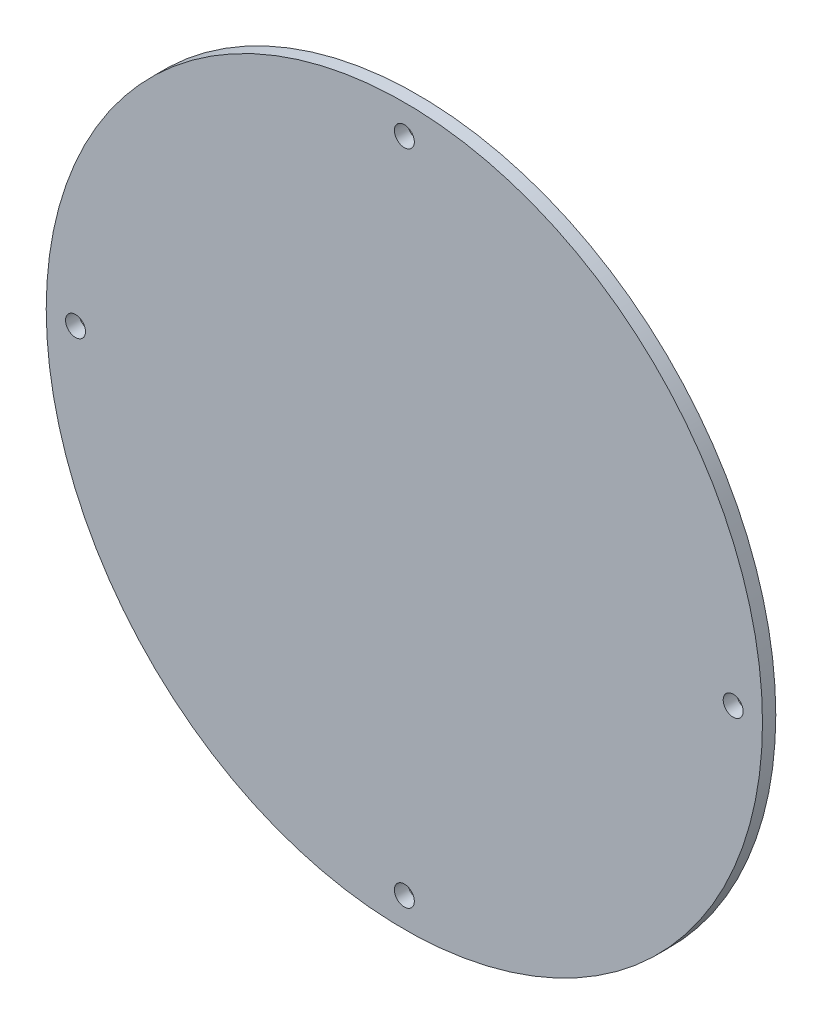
ISO-10303-21;
HEADER;
FILE_DESCRIPTION(('STEP AP214'),'2;1');
FILE_NAME('part.step','',(''),(''),'','','');
FILE_SCHEMA(('AUTOMOTIVE_DESIGN { 1 0 10303 214 1 1 1 1 }'));
ENDSEC;
DATA;
#1=APPLICATION_CONTEXT('core data for automotive mechanical design processes');
#2=APPLICATION_PROTOCOL_DEFINITION('international standard','automotive_design',2000,#1);
#3=PRODUCT_CONTEXT('',#1,'mechanical');
#4=PRODUCT('Part','Part','',(#3));
#5=PRODUCT_RELATED_PRODUCT_CATEGORY('part','',(#4));
#6=PRODUCT_DEFINITION_FORMATION('','',#4);
#7=PRODUCT_DEFINITION_CONTEXT('part definition',#1,'design');
#8=PRODUCT_DEFINITION('design','',#6,#7);
#9=PRODUCT_DEFINITION_SHAPE('','',#8);
#10=(LENGTH_UNIT() NAMED_UNIT(*) SI_UNIT(.MILLI.,.METRE.));
#11=(NAMED_UNIT(*) PLANE_ANGLE_UNIT() SI_UNIT($,.RADIAN.));
#12=(NAMED_UNIT(*) SI_UNIT($,.STERADIAN.) SOLID_ANGLE_UNIT());
#13=UNCERTAINTY_MEASURE_WITH_UNIT(LENGTH_MEASURE(1.E-05),#10,'distance_accuracy_value','');
#14=(GEOMETRIC_REPRESENTATION_CONTEXT(3) GLOBAL_UNCERTAINTY_ASSIGNED_CONTEXT((#13)) GLOBAL_UNIT_ASSIGNED_CONTEXT((#10,
#11,#12)) REPRESENTATION_CONTEXT('',''));
#15=CARTESIAN_POINT('',(0.,0.,0.));
#16=DIRECTION('',(0.,0.,1.));
#17=DIRECTION('',(1.,0.,0.));
#18=AXIS2_PLACEMENT_3D('',#15,#16,#17);
#19=CARTESIAN_POINT('',(0.,78.5,3.175));
#20=DIRECTION('',(0.,0.,-1.));
#21=DIRECTION('',(-1.,0.,0.));
#22=AXIS2_PLACEMENT_3D('',#19,#20,#21);
#23=CYLINDRICAL_SURFACE('',#22,2.38125);
#24=CARTESIAN_POINT('',(0.,78.5,3.175));
#25=DIRECTION('',(0.,0.,1.));
#26=DIRECTION('',(1.,0.,0.));
#27=AXIS2_PLACEMENT_3D('',#24,#25,#26);
#28=CIRCLE('',#27,2.38125);
#29=CARTESIAN_POINT('',(2.38125,78.5,3.175));
#30=VERTEX_POINT('',#29);
#31=EDGE_CURVE('E43',#30,#30,#28,.T.);
#32=ORIENTED_EDGE('',*,*,#31,.T.);
#33=EDGE_LOOP('',(#32));
#34=FACE_BOUND('',#33,.T.);
#35=CARTESIAN_POINT('',(0.,78.5,0.));
#36=DIRECTION('',(0.,0.,1.));
#37=DIRECTION('',(1.,0.,0.));
#38=AXIS2_PLACEMENT_3D('',#35,#36,#37);
#39=CIRCLE('',#38,2.38125);
#40=CARTESIAN_POINT('',(2.38125,78.5,0.));
#41=VERTEX_POINT('',#40);
#42=EDGE_CURVE('E60',#41,#41,#39,.T.);
#43=ORIENTED_EDGE('',*,*,#42,.F.);
#44=EDGE_LOOP('',(#43));
#45=FACE_BOUND('',#44,.T.);
#46=ADVANCED_FACE('F35',(#34,#45),#23,.F.);
#47=CARTESIAN_POINT('',(78.5,0.,3.175));
#48=DIRECTION('',(0.,0.,-1.));
#49=DIRECTION('',(-1.,0.,0.));
#50=AXIS2_PLACEMENT_3D('',#47,#48,#49);
#51=CYLINDRICAL_SURFACE('',#50,2.38125000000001);
#52=CARTESIAN_POINT('',(78.5,0.,3.175));
#53=DIRECTION('',(0.,0.,1.));
#54=DIRECTION('',(1.,0.,0.));
#55=AXIS2_PLACEMENT_3D('',#52,#53,#54);
#56=CIRCLE('',#55,2.38125000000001);
#57=CARTESIAN_POINT('',(80.88125,0.,3.175));
#58=VERTEX_POINT('',#57);
#59=EDGE_CURVE('E48',#58,#58,#56,.T.);
#60=ORIENTED_EDGE('',*,*,#59,.T.);
#61=EDGE_LOOP('',(#60));
#62=FACE_BOUND('',#61,.T.);
#63=CARTESIAN_POINT('',(78.5,0.,0.));
#64=DIRECTION('',(0.,0.,1.));
#65=DIRECTION('',(1.,0.,0.));
#66=AXIS2_PLACEMENT_3D('',#63,#64,#65);
#67=CIRCLE('',#66,2.38125000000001);
#68=CARTESIAN_POINT('',(80.88125,0.,0.));
#69=VERTEX_POINT('',#68);
#70=EDGE_CURVE('E58',#69,#69,#67,.T.);
#71=ORIENTED_EDGE('',*,*,#70,.F.);
#72=EDGE_LOOP('',(#71));
#73=FACE_BOUND('',#72,.T.);
#74=ADVANCED_FACE('F78',(#62,#73),#51,.F.);
#75=CARTESIAN_POINT('',(0.,-78.5,3.175));
#76=DIRECTION('',(0.,0.,-1.));
#77=DIRECTION('',(-1.,0.,0.));
#78=AXIS2_PLACEMENT_3D('',#75,#76,#77);
#79=CYLINDRICAL_SURFACE('',#78,2.38125);
#80=CARTESIAN_POINT('',(0.,-78.5,3.175));
#81=DIRECTION('',(0.,0.,1.));
#82=DIRECTION('',(1.,0.,0.));
#83=AXIS2_PLACEMENT_3D('',#80,#81,#82);
#84=CIRCLE('',#83,2.38125);
#85=CARTESIAN_POINT('',(2.38125000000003,-78.5,3.175));
#86=VERTEX_POINT('',#85);
#87=EDGE_CURVE('E69',#86,#86,#84,.T.);
#88=ORIENTED_EDGE('',*,*,#87,.T.);
#89=EDGE_LOOP('',(#88));
#90=FACE_BOUND('',#89,.T.);
#91=CARTESIAN_POINT('',(0.,-78.5,0.));
#92=DIRECTION('',(0.,0.,1.));
#93=DIRECTION('',(1.,0.,0.));
#94=AXIS2_PLACEMENT_3D('',#91,#92,#93);
#95=CIRCLE('',#94,2.38125);
#96=CARTESIAN_POINT('',(2.38125000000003,-78.5,0.));
#97=VERTEX_POINT('',#96);
#98=EDGE_CURVE('E55',#97,#97,#95,.T.);
#99=ORIENTED_EDGE('',*,*,#98,.F.);
#100=EDGE_LOOP('',(#99));
#101=FACE_BOUND('',#100,.T.);
#102=ADVANCED_FACE('F96',(#90,#101),#79,.F.);
#103=CARTESIAN_POINT('',(-78.5,0.,3.175));
#104=DIRECTION('',(0.,0.,-1.));
#105=DIRECTION('',(-1.,0.,0.));
#106=AXIS2_PLACEMENT_3D('',#103,#104,#105);
#107=CYLINDRICAL_SURFACE('',#106,2.38125000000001);
#108=CARTESIAN_POINT('',(-78.5,0.,3.175));
#109=DIRECTION('',(0.,0.,1.));
#110=DIRECTION('',(1.,0.,0.));
#111=AXIS2_PLACEMENT_3D('',#108,#109,#110);
#112=CIRCLE('',#111,2.38125000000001);
#113=CARTESIAN_POINT('',(-76.11875,0.,3.175));
#114=VERTEX_POINT('',#113);
#115=EDGE_CURVE('E65',#114,#114,#112,.T.);
#116=ORIENTED_EDGE('',*,*,#115,.T.);
#117=EDGE_LOOP('',(#116));
#118=FACE_BOUND('',#117,.T.);
#119=CARTESIAN_POINT('',(-78.5,0.,0.));
#120=DIRECTION('',(0.,0.,1.));
#121=DIRECTION('',(1.,0.,0.));
#122=AXIS2_PLACEMENT_3D('',#119,#120,#121);
#123=CIRCLE('',#122,2.38125000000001);
#124=CARTESIAN_POINT('',(-76.11875,0.,0.));
#125=VERTEX_POINT('',#124);
#126=EDGE_CURVE('E52',#125,#125,#123,.T.);
#127=ORIENTED_EDGE('',*,*,#126,.F.);
#128=EDGE_LOOP('',(#127));
#129=FACE_BOUND('',#128,.T.);
#130=ADVANCED_FACE('F37',(#118,#129),#107,.F.);
#131=CARTESIAN_POINT('',(0.,0.,3.175));
#132=DIRECTION('',(0.,0.,-1.));
#133=DIRECTION('',(-1.,0.,0.));
#134=AXIS2_PLACEMENT_3D('',#131,#132,#133);
#135=CYLINDRICAL_SURFACE('',#134,85.5);
#136=CARTESIAN_POINT('',(0.,0.,3.175));
#137=DIRECTION('',(0.,0.,1.));
#138=DIRECTION('',(1.,0.,0.));
#139=AXIS2_PLACEMENT_3D('',#136,#137,#138);
#140=CIRCLE('',#139,85.5);
#141=CARTESIAN_POINT('',(85.5,0.,3.175));
#142=VERTEX_POINT('',#141);
#143=EDGE_CURVE('E10',#142,#142,#140,.T.);
#144=ORIENTED_EDGE('',*,*,#143,.F.);
#145=EDGE_LOOP('',(#144));
#146=FACE_BOUND('',#145,.T.);
#147=CARTESIAN_POINT('',(0.,0.,0.));
#148=DIRECTION('',(0.,0.,1.));
#149=DIRECTION('',(1.,0.,0.));
#150=AXIS2_PLACEMENT_3D('',#147,#148,#149);
#151=CIRCLE('',#150,85.5);
#152=CARTESIAN_POINT('',(85.5,0.,0.));
#153=VERTEX_POINT('',#152);
#154=EDGE_CURVE('E39',#153,#153,#151,.T.);
#155=ORIENTED_EDGE('',*,*,#154,.T.);
#156=EDGE_LOOP('',(#155));
#157=FACE_BOUND('',#156,.T.);
#158=ADVANCED_FACE('F85',(#146,#157),#135,.T.);
#159=CARTESIAN_POINT('',(0.,0.,3.175));
#160=DIRECTION('',(0.,0.,1.));
#161=DIRECTION('',(1.,0.,0.));
#162=AXIS2_PLACEMENT_3D('',#159,#160,#161);
#163=PLANE('',#162);
#164=ORIENTED_EDGE('',*,*,#115,.F.);
#165=EDGE_LOOP('',(#164));
#166=FACE_BOUND('',#165,.T.);
#167=ORIENTED_EDGE('',*,*,#87,.F.);
#168=EDGE_LOOP('',(#167));
#169=FACE_BOUND('',#168,.T.);
#170=ORIENTED_EDGE('',*,*,#59,.F.);
#171=EDGE_LOOP('',(#170));
#172=FACE_BOUND('',#171,.T.);
#173=ORIENTED_EDGE('',*,*,#31,.F.);
#174=EDGE_LOOP('',(#173));
#175=FACE_BOUND('',#174,.T.);
#176=ORIENTED_EDGE('',*,*,#143,.T.);
#177=EDGE_LOOP('',(#176));
#178=FACE_BOUND('',#177,.T.);
#179=ADVANCED_FACE('F81',(#166,#169,#172,#175,#178),#163,.T.);
#180=CARTESIAN_POINT('',(0.,0.,0.));
#181=DIRECTION('',(0.,0.,1.));
#182=DIRECTION('',(1.,0.,0.));
#183=AXIS2_PLACEMENT_3D('',#180,#181,#182);
#184=PLANE('',#183);
#185=ORIENTED_EDGE('',*,*,#126,.T.);
#186=EDGE_LOOP('',(#185));
#187=FACE_BOUND('',#186,.T.);
#188=ORIENTED_EDGE('',*,*,#98,.T.);
#189=EDGE_LOOP('',(#188));
#190=FACE_BOUND('',#189,.T.);
#191=ORIENTED_EDGE('',*,*,#70,.T.);
#192=EDGE_LOOP('',(#191));
#193=FACE_BOUND('',#192,.T.);
#194=ORIENTED_EDGE('',*,*,#42,.T.);
#195=EDGE_LOOP('',(#194));
#196=FACE_BOUND('',#195,.T.);
#197=ORIENTED_EDGE('',*,*,#154,.F.);
#198=EDGE_LOOP('',(#197));
#199=FACE_BOUND('',#198,.T.);
#200=ADVANCED_FACE('F84',(#187,#190,#193,#196,#199),#184,.F.);
#201=CLOSED_SHELL('',(#46,#74,#102,#130,#158,#179,#200));
#202=MANIFOLD_SOLID_BREP('B2',#201);
#203=ADVANCED_BREP_SHAPE_REPRESENTATION('',(#18,#202),#14);
#204=SHAPE_DEFINITION_REPRESENTATION(#9,#203);
ENDSEC;
END-ISO-10303-21;
